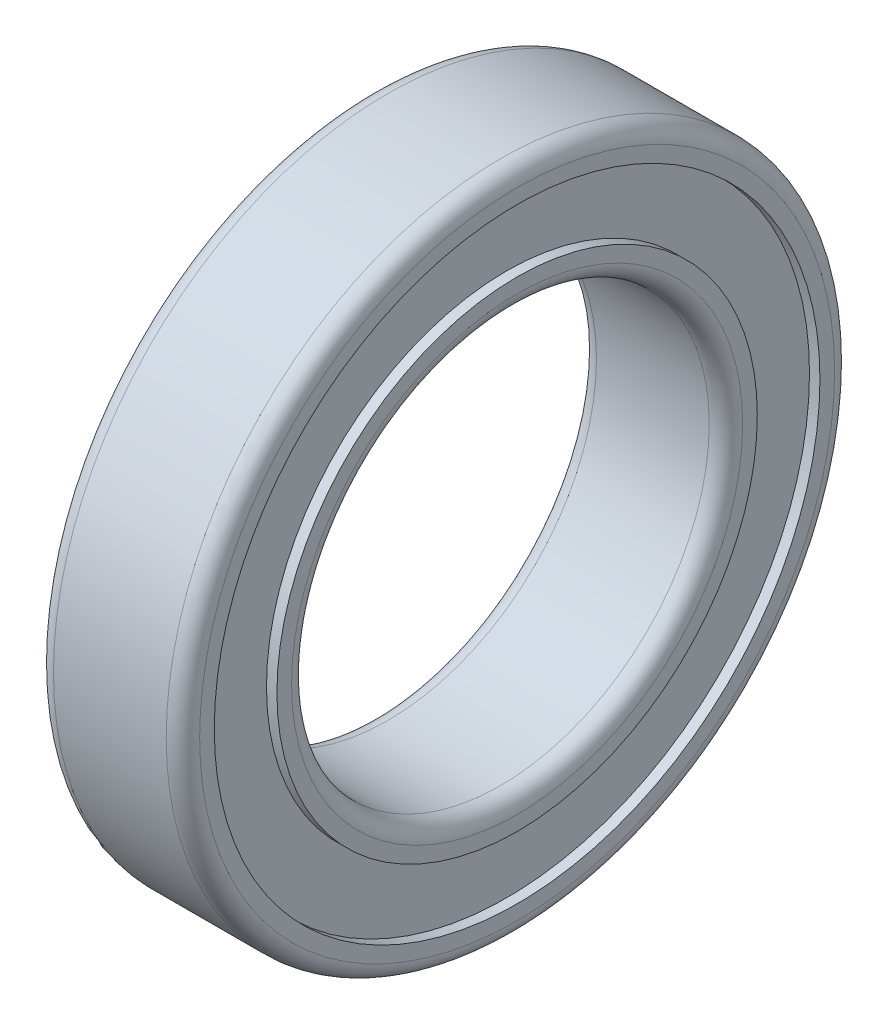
ISO-10303-21;
HEADER;
FILE_DESCRIPTION(('STEP AP214'),'2;1');
FILE_NAME('part.step','',(''),(''),'','','');
FILE_SCHEMA(('AUTOMOTIVE_DESIGN { 1 0 10303 214 1 1 1 1 }'));
ENDSEC;
DATA;
#1=APPLICATION_CONTEXT('core data for automotive mechanical design processes');
#2=APPLICATION_PROTOCOL_DEFINITION('international standard','automotive_design',2000,#1);
#3=PRODUCT_CONTEXT('',#1,'mechanical');
#4=PRODUCT('Part','Part','',(#3));
#5=PRODUCT_RELATED_PRODUCT_CATEGORY('part','',(#4));
#6=PRODUCT_DEFINITION_FORMATION('','',#4);
#7=PRODUCT_DEFINITION_CONTEXT('part definition',#1,'design');
#8=PRODUCT_DEFINITION('design','',#6,#7);
#9=PRODUCT_DEFINITION_SHAPE('','',#8);
#10=(LENGTH_UNIT() NAMED_UNIT(*) SI_UNIT(.MILLI.,.METRE.));
#11=(NAMED_UNIT(*) PLANE_ANGLE_UNIT() SI_UNIT($,.RADIAN.));
#12=(NAMED_UNIT(*) SI_UNIT($,.STERADIAN.) SOLID_ANGLE_UNIT());
#13=UNCERTAINTY_MEASURE_WITH_UNIT(LENGTH_MEASURE(1.E-05),#10,'distance_accuracy_value','');
#14=(GEOMETRIC_REPRESENTATION_CONTEXT(3) GLOBAL_UNCERTAINTY_ASSIGNED_CONTEXT((#13)) GLOBAL_UNIT_ASSIGNED_CONTEXT((#10,
#11,#12)) REPRESENTATION_CONTEXT('',''));
#15=CARTESIAN_POINT('',(0.,0.,0.));
#16=DIRECTION('',(0.,0.,1.));
#17=DIRECTION('',(1.,0.,0.));
#18=AXIS2_PLACEMENT_3D('',#15,#16,#17);
#19=CARTESIAN_POINT('',(-3.5,10.,0.));
#20=DIRECTION('',(-1.,0.,0.));
#21=DIRECTION('',(0.,0.,1.));
#22=AXIS2_PLACEMENT_3D('',#19,#20,#21);
#23=PLANE('',#22);
#24=CARTESIAN_POINT('',(-3.5,0.,0.));
#25=DIRECTION('',(-1.,0.,0.));
#26=DIRECTION('',(0.,0.,1.));
#27=AXIS2_PLACEMENT_3D('',#24,#25,#26);
#28=CIRCLE('',#27,10.8);
#29=CARTESIAN_POINT('',(-3.5,0.,10.8));
#30=VERTEX_POINT('',#29);
#31=EDGE_CURVE('E50',#30,#30,#28,.F.);
#32=ORIENTED_EDGE('',*,*,#31,.T.);
#33=EDGE_LOOP('',(#32));
#34=FACE_BOUND('',#33,.T.);
#35=CARTESIAN_POINT('',(-3.5,0.,0.));
#36=DIRECTION('',(1.,0.,0.));
#37=DIRECTION('',(0.,0.,-1.));
#38=AXIS2_PLACEMENT_3D('',#35,#36,#37);
#39=CIRCLE('',#38,11.5);
#40=CARTESIAN_POINT('',(-3.5,0.,-11.5));
#41=VERTEX_POINT('',#40);
#42=EDGE_CURVE('E88',#41,#41,#39,.T.);
#43=ORIENTED_EDGE('',*,*,#42,.F.);
#44=EDGE_LOOP('',(#43));
#45=FACE_BOUND('',#44,.T.);
#46=ADVANCED_FACE('F35',(#34,#45),#23,.T.);
#47=CARTESIAN_POINT('',(0.,0.,0.));
#48=DIRECTION('',(1.,0.,0.));
#49=DIRECTION('',(0.,0.,-1.));
#50=AXIS2_PLACEMENT_3D('',#47,#48,#49);
#51=CYLINDRICAL_SURFACE('',#50,10.);
#52=CARTESIAN_POINT('',(-2.7,0.,0.));
#53=DIRECTION('',(-1.,0.,0.));
#54=DIRECTION('',(0.,0.,1.));
#55=AXIS2_PLACEMENT_3D('',#52,#53,#54);
#56=CIRCLE('',#55,10.);
#57=CARTESIAN_POINT('',(-2.7,0.,10.));
#58=VERTEX_POINT('',#57);
#59=EDGE_CURVE('E42',#58,#58,#56,.T.);
#60=ORIENTED_EDGE('',*,*,#59,.T.);
#61=EDGE_LOOP('',(#60));
#62=FACE_BOUND('',#61,.T.);
#63=CARTESIAN_POINT('',(2.7,0.,0.));
#64=DIRECTION('',(1.,0.,0.));
#65=DIRECTION('',(0.,0.,-1.));
#66=AXIS2_PLACEMENT_3D('',#63,#64,#65);
#67=CIRCLE('',#66,10.);
#68=CARTESIAN_POINT('',(2.7,0.,-10.));
#69=VERTEX_POINT('',#68);
#70=EDGE_CURVE('E46',#69,#69,#67,.T.);
#71=ORIENTED_EDGE('',*,*,#70,.T.);
#72=EDGE_LOOP('',(#71));
#73=FACE_BOUND('',#72,.T.);
#74=ADVANCED_FACE('F96',(#62,#73),#51,.F.);
#75=CARTESIAN_POINT('',(3.5,10.,0.));
#76=DIRECTION('',(1.,0.,0.));
#77=DIRECTION('',(0.,0.,-1.));
#78=AXIS2_PLACEMENT_3D('',#75,#76,#77);
#79=PLANE('',#78);
#80=CARTESIAN_POINT('',(3.5,0.,0.));
#81=DIRECTION('',(1.,0.,0.));
#82=DIRECTION('',(0.,0.,-1.));
#83=AXIS2_PLACEMENT_3D('',#80,#81,#82);
#84=CIRCLE('',#83,10.8);
#85=CARTESIAN_POINT('',(3.5,0.,-10.8));
#86=VERTEX_POINT('',#85);
#87=EDGE_CURVE('E10',#86,#86,#84,.F.);
#88=ORIENTED_EDGE('',*,*,#87,.T.);
#89=EDGE_LOOP('',(#88));
#90=FACE_BOUND('',#89,.T.);
#91=CARTESIAN_POINT('',(3.5,0.,0.));
#92=DIRECTION('',(1.,0.,0.));
#93=DIRECTION('',(0.,0.,-1.));
#94=AXIS2_PLACEMENT_3D('',#91,#92,#93);
#95=CIRCLE('',#94,11.5);
#96=CARTESIAN_POINT('',(3.5,0.,-11.5));
#97=VERTEX_POINT('',#96);
#98=EDGE_CURVE('E67',#97,#97,#95,.T.);
#99=ORIENTED_EDGE('',*,*,#98,.T.);
#100=EDGE_LOOP('',(#99));
#101=FACE_BOUND('',#100,.T.);
#102=ADVANCED_FACE('F102',(#90,#101),#79,.T.);
#103=CARTESIAN_POINT('',(0.,0.,0.));
#104=DIRECTION('',(1.,0.,0.));
#105=DIRECTION('',(0.,0.,-1.));
#106=AXIS2_PLACEMENT_3D('',#103,#104,#105);
#107=CYLINDRICAL_SURFACE('',#106,11.5);
#108=CARTESIAN_POINT('',(3.,0.,0.));
#109=DIRECTION('',(1.,0.,0.));
#110=DIRECTION('',(0.,0.,-1.));
#111=AXIS2_PLACEMENT_3D('',#108,#109,#110);
#112=CIRCLE('',#111,11.5);
#113=CARTESIAN_POINT('',(3.,0.,-11.5));
#114=VERTEX_POINT('',#113);
#115=EDGE_CURVE('E70',#114,#114,#112,.T.);
#116=ORIENTED_EDGE('',*,*,#115,.T.);
#117=EDGE_LOOP('',(#116));
#118=FACE_BOUND('',#117,.T.);
#119=ORIENTED_EDGE('',*,*,#98,.F.);
#120=EDGE_LOOP('',(#119));
#121=FACE_BOUND('',#120,.T.);
#122=ADVANCED_FACE('F190',(#118,#121),#107,.T.);
#123=CARTESIAN_POINT('',(3.,11.5,0.));
#124=DIRECTION('',(1.,0.,0.));
#125=DIRECTION('',(0.,0.,-1.));
#126=AXIS2_PLACEMENT_3D('',#123,#124,#125);
#127=PLANE('',#126);
#128=CARTESIAN_POINT('',(3.,0.,0.));
#129=DIRECTION('',(1.,0.,0.));
#130=DIRECTION('',(0.,0.,-1.));
#131=AXIS2_PLACEMENT_3D('',#128,#129,#130);
#132=CIRCLE('',#131,14.5);
#133=CARTESIAN_POINT('',(3.,0.,-14.5));
#134=VERTEX_POINT('',#133);
#135=EDGE_CURVE('E73',#134,#134,#132,.T.);
#136=ORIENTED_EDGE('',*,*,#135,.T.);
#137=EDGE_LOOP('',(#136));
#138=FACE_BOUND('',#137,.T.);
#139=ORIENTED_EDGE('',*,*,#115,.F.);
#140=EDGE_LOOP('',(#139));
#141=FACE_BOUND('',#140,.T.);
#142=ADVANCED_FACE('F233',(#138,#141),#127,.T.);
#143=CARTESIAN_POINT('',(0.,0.,0.));
#144=DIRECTION('',(1.,0.,0.));
#145=DIRECTION('',(0.,0.,-1.));
#146=AXIS2_PLACEMENT_3D('',#143,#144,#145);
#147=CYLINDRICAL_SURFACE('',#146,14.5);
#148=CARTESIAN_POINT('',(3.5,0.,0.));
#149=DIRECTION('',(1.,0.,0.));
#150=DIRECTION('',(0.,0.,-1.));
#151=AXIS2_PLACEMENT_3D('',#148,#149,#150);
#152=CIRCLE('',#151,14.5);
#153=CARTESIAN_POINT('',(3.5,0.,-14.5));
#154=VERTEX_POINT('',#153);
#155=EDGE_CURVE('E76',#154,#154,#152,.T.);
#156=ORIENTED_EDGE('',*,*,#155,.T.);
#157=EDGE_LOOP('',(#156));
#158=FACE_BOUND('',#157,.T.);
#159=ORIENTED_EDGE('',*,*,#135,.F.);
#160=EDGE_LOOP('',(#159));
#161=FACE_BOUND('',#160,.T.);
#162=ADVANCED_FACE('F178',(#158,#161),#147,.F.);
#163=CARTESIAN_POINT('',(3.5,14.5,0.));
#164=DIRECTION('',(1.,0.,0.));
#165=DIRECTION('',(0.,0.,-1.));
#166=AXIS2_PLACEMENT_3D('',#163,#164,#165);
#167=PLANE('',#166);
#168=CARTESIAN_POINT('',(3.5,0.,0.));
#169=DIRECTION('',(1.,0.,0.));
#170=DIRECTION('',(0.,0.,-1.));
#171=AXIS2_PLACEMENT_3D('',#168,#169,#170);
#172=CIRCLE('',#171,15.2);
#173=CARTESIAN_POINT('',(3.5,0.,-15.2));
#174=VERTEX_POINT('',#173);
#175=EDGE_CURVE('E64',#174,#174,#172,.T.);
#176=ORIENTED_EDGE('',*,*,#175,.T.);
#177=EDGE_LOOP('',(#176));
#178=FACE_BOUND('',#177,.T.);
#179=ORIENTED_EDGE('',*,*,#155,.F.);
#180=EDGE_LOOP('',(#179));
#181=FACE_BOUND('',#180,.T.);
#182=ADVANCED_FACE('F168',(#178,#181),#167,.T.);
#183=CARTESIAN_POINT('',(0.,0.,0.));
#184=DIRECTION('',(1.,0.,0.));
#185=DIRECTION('',(0.,0.,-1.));
#186=AXIS2_PLACEMENT_3D('',#183,#184,#185);
#187=CYLINDRICAL_SURFACE('',#186,16.);
#188=CARTESIAN_POINT('',(2.7,0.,0.));
#189=DIRECTION('',(1.,0.,0.));
#190=DIRECTION('',(0.,0.,-1.));
#191=AXIS2_PLACEMENT_3D('',#188,#189,#190);
#192=CIRCLE('',#191,16.);
#193=CARTESIAN_POINT('',(2.7,0.,-16.));
#194=VERTEX_POINT('',#193);
#195=EDGE_CURVE('E58',#194,#194,#192,.F.);
#196=ORIENTED_EDGE('',*,*,#195,.T.);
#197=EDGE_LOOP('',(#196));
#198=FACE_BOUND('',#197,.T.);
#199=CARTESIAN_POINT('',(-2.7,0.,0.));
#200=DIRECTION('',(-1.,0.,0.));
#201=DIRECTION('',(0.,0.,1.));
#202=AXIS2_PLACEMENT_3D('',#199,#200,#201);
#203=CIRCLE('',#202,16.);
#204=CARTESIAN_POINT('',(-2.7,0.,16.));
#205=VERTEX_POINT('',#204);
#206=EDGE_CURVE('E61',#205,#205,#203,.F.);
#207=ORIENTED_EDGE('',*,*,#206,.T.);
#208=EDGE_LOOP('',(#207));
#209=FACE_BOUND('',#208,.T.);
#210=ADVANCED_FACE('F156',(#198,#209),#187,.T.);
#211=CARTESIAN_POINT('',(-3.5,14.5,0.));
#212=DIRECTION('',(-1.,0.,0.));
#213=DIRECTION('',(0.,0.,1.));
#214=AXIS2_PLACEMENT_3D('',#211,#212,#213);
#215=PLANE('',#214);
#216=CARTESIAN_POINT('',(-3.5,0.,0.));
#217=DIRECTION('',(-1.,0.,0.));
#218=DIRECTION('',(0.,0.,1.));
#219=AXIS2_PLACEMENT_3D('',#216,#217,#218);
#220=CIRCLE('',#219,15.2);
#221=CARTESIAN_POINT('',(-3.5,0.,15.2));
#222=VERTEX_POINT('',#221);
#223=EDGE_CURVE('E55',#222,#222,#220,.T.);
#224=ORIENTED_EDGE('',*,*,#223,.T.);
#225=EDGE_LOOP('',(#224));
#226=FACE_BOUND('',#225,.T.);
#227=CARTESIAN_POINT('',(-3.5,0.,0.));
#228=DIRECTION('',(1.,0.,0.));
#229=DIRECTION('',(0.,0.,-1.));
#230=AXIS2_PLACEMENT_3D('',#227,#228,#229);
#231=CIRCLE('',#230,14.5);
#232=CARTESIAN_POINT('',(-3.5,0.,-14.5));
#233=VERTEX_POINT('',#232);
#234=EDGE_CURVE('E79',#233,#233,#231,.T.);
#235=ORIENTED_EDGE('',*,*,#234,.T.);
#236=EDGE_LOOP('',(#235));
#237=FACE_BOUND('',#236,.T.);
#238=ADVANCED_FACE('F150',(#226,#237),#215,.T.);
#239=CARTESIAN_POINT('',(0.,0.,0.));
#240=DIRECTION('',(1.,0.,0.));
#241=DIRECTION('',(0.,0.,-1.));
#242=AXIS2_PLACEMENT_3D('',#239,#240,#241);
#243=CYLINDRICAL_SURFACE('',#242,14.5);
#244=CARTESIAN_POINT('',(-3.,0.,0.));
#245=DIRECTION('',(1.,0.,0.));
#246=DIRECTION('',(0.,0.,-1.));
#247=AXIS2_PLACEMENT_3D('',#244,#245,#246);
#248=CIRCLE('',#247,14.5);
#249=CARTESIAN_POINT('',(-3.,0.,-14.5));
#250=VERTEX_POINT('',#249);
#251=EDGE_CURVE('E82',#250,#250,#248,.T.);
#252=ORIENTED_EDGE('',*,*,#251,.T.);
#253=EDGE_LOOP('',(#252));
#254=FACE_BOUND('',#253,.T.);
#255=ORIENTED_EDGE('',*,*,#234,.F.);
#256=EDGE_LOOP('',(#255));
#257=FACE_BOUND('',#256,.T.);
#258=ADVANCED_FACE('F155',(#254,#257),#243,.F.);
#259=CARTESIAN_POINT('',(-3.,11.5,0.));
#260=DIRECTION('',(-1.,0.,0.));
#261=DIRECTION('',(0.,0.,1.));
#262=AXIS2_PLACEMENT_3D('',#259,#260,#261);
#263=PLANE('',#262);
#264=CARTESIAN_POINT('',(-3.,0.,0.));
#265=DIRECTION('',(1.,0.,0.));
#266=DIRECTION('',(0.,0.,-1.));
#267=AXIS2_PLACEMENT_3D('',#264,#265,#266);
#268=CIRCLE('',#267,11.5);
#269=CARTESIAN_POINT('',(-3.,0.,-11.5));
#270=VERTEX_POINT('',#269);
#271=EDGE_CURVE('E85',#270,#270,#268,.T.);
#272=ORIENTED_EDGE('',*,*,#271,.T.);
#273=EDGE_LOOP('',(#272));
#274=FACE_BOUND('',#273,.T.);
#275=ORIENTED_EDGE('',*,*,#251,.F.);
#276=EDGE_LOOP('',(#275));
#277=FACE_BOUND('',#276,.T.);
#278=ADVANCED_FACE('F208',(#274,#277),#263,.T.);
#279=CARTESIAN_POINT('',(0.,0.,0.));
#280=DIRECTION('',(1.,0.,0.));
#281=DIRECTION('',(0.,0.,-1.));
#282=AXIS2_PLACEMENT_3D('',#279,#280,#281);
#283=CYLINDRICAL_SURFACE('',#282,11.5);
#284=ORIENTED_EDGE('',*,*,#42,.T.);
#285=EDGE_LOOP('',(#284));
#286=FACE_BOUND('',#285,.T.);
#287=ORIENTED_EDGE('',*,*,#271,.F.);
#288=EDGE_LOOP('',(#287));
#289=FACE_BOUND('',#288,.T.);
#290=ADVANCED_FACE('F92',(#286,#289),#283,.T.);
#291=CARTESIAN_POINT('',(2.7,0.,0.));
#292=DIRECTION('',(1.,0.,0.));
#293=DIRECTION('',(0.,0.,-1.));
#294=AXIS2_PLACEMENT_3D('',#291,#292,#293);
#295=TOROIDAL_SURFACE('',#294,15.2,0.8);
#296=ORIENTED_EDGE('',*,*,#195,.F.);
#297=EDGE_LOOP('',(#296));
#298=FACE_BOUND('',#297,.T.);
#299=ORIENTED_EDGE('',*,*,#175,.F.);
#300=EDGE_LOOP('',(#299));
#301=FACE_BOUND('',#300,.T.);
#302=ADVANCED_FACE('F106',(#298,#301),#295,.T.);
#303=CARTESIAN_POINT('',(-2.7,0.,0.));
#304=DIRECTION('',(-1.,0.,0.));
#305=DIRECTION('',(0.,0.,1.));
#306=AXIS2_PLACEMENT_3D('',#303,#304,#305);
#307=TOROIDAL_SURFACE('',#306,15.2,0.8);
#308=ORIENTED_EDGE('',*,*,#223,.F.);
#309=EDGE_LOOP('',(#308));
#310=FACE_BOUND('',#309,.T.);
#311=ORIENTED_EDGE('',*,*,#206,.F.);
#312=EDGE_LOOP('',(#311));
#313=FACE_BOUND('',#312,.T.);
#314=ADVANCED_FACE('F109',(#310,#313),#307,.T.);
#315=CARTESIAN_POINT('',(-2.7,0.,0.));
#316=DIRECTION('',(-1.,0.,0.));
#317=DIRECTION('',(0.,0.,1.));
#318=AXIS2_PLACEMENT_3D('',#315,#316,#317);
#319=TOROIDAL_SURFACE('',#318,10.8,0.8);
#320=ORIENTED_EDGE('',*,*,#59,.F.);
#321=EDGE_LOOP('',(#320));
#322=FACE_BOUND('',#321,.T.);
#323=ORIENTED_EDGE('',*,*,#31,.F.);
#324=EDGE_LOOP('',(#323));
#325=FACE_BOUND('',#324,.T.);
#326=ADVANCED_FACE('F112',(#322,#325),#319,.T.);
#327=CARTESIAN_POINT('',(2.7,0.,0.));
#328=DIRECTION('',(1.,0.,0.));
#329=DIRECTION('',(0.,0.,-1.));
#330=AXIS2_PLACEMENT_3D('',#327,#328,#329);
#331=TOROIDAL_SURFACE('',#330,10.8,0.8);
#332=ORIENTED_EDGE('',*,*,#87,.F.);
#333=EDGE_LOOP('',(#332));
#334=FACE_BOUND('',#333,.T.);
#335=ORIENTED_EDGE('',*,*,#70,.F.);
#336=EDGE_LOOP('',(#335));
#337=FACE_BOUND('',#336,.T.);
#338=ADVANCED_FACE('F37',(#334,#337),#331,.T.);
#339=CLOSED_SHELL('',(#46,#74,#102,#122,#142,#162,#182,#210,#238,#258,#278,#290,#302,#314,#326,#338));
#340=MANIFOLD_SOLID_BREP('B2',#339);
#341=ADVANCED_BREP_SHAPE_REPRESENTATION('',(#18,#340),#14);
#342=SHAPE_DEFINITION_REPRESENTATION(#9,#341);
ENDSEC;
END-ISO-10303-21;
